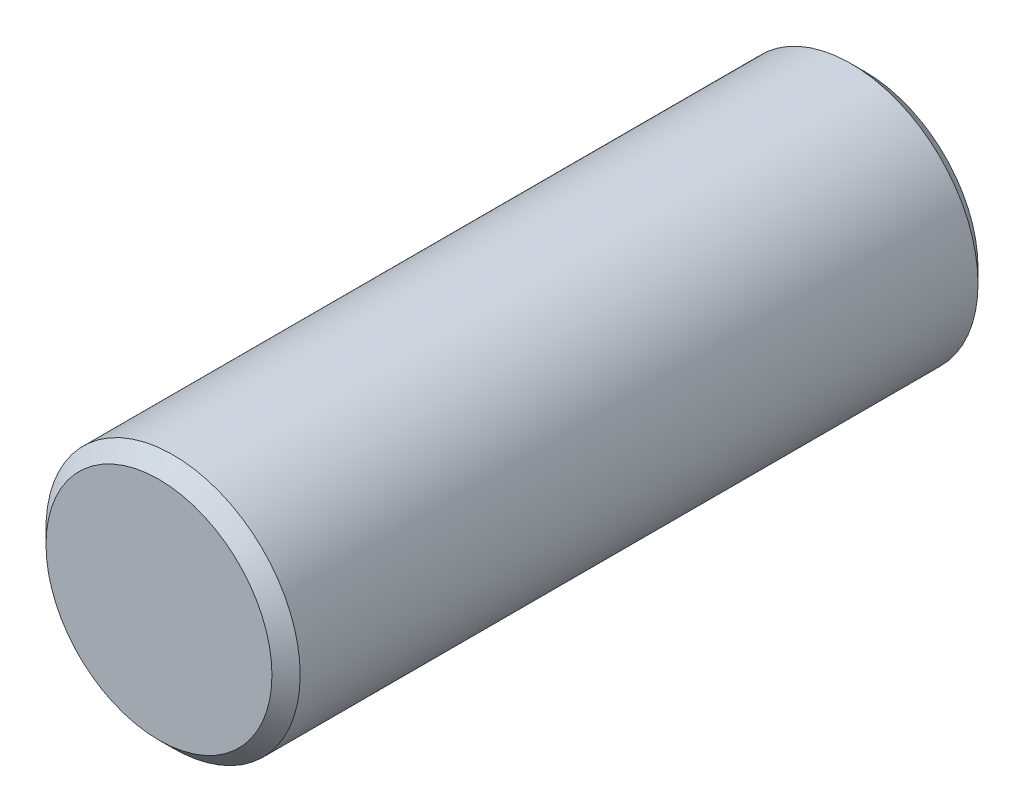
ISO-10303-21;
HEADER;
FILE_DESCRIPTION(('STEP AP214'),'2;1');
FILE_NAME('part.step','',(''),(''),'','','');
FILE_SCHEMA(('AUTOMOTIVE_DESIGN { 1 0 10303 214 1 1 1 1 }'));
ENDSEC;
DATA;
#1=APPLICATION_CONTEXT('core data for automotive mechanical design processes');
#2=APPLICATION_PROTOCOL_DEFINITION('international standard','automotive_design',2000,#1);
#3=PRODUCT_CONTEXT('',#1,'mechanical');
#4=PRODUCT('Part','Part','',(#3));
#5=PRODUCT_RELATED_PRODUCT_CATEGORY('part','',(#4));
#6=PRODUCT_DEFINITION_FORMATION('','',#4);
#7=PRODUCT_DEFINITION_CONTEXT('part definition',#1,'design');
#8=PRODUCT_DEFINITION('design','',#6,#7);
#9=PRODUCT_DEFINITION_SHAPE('','',#8);
#10=(LENGTH_UNIT() NAMED_UNIT(*) SI_UNIT(.MILLI.,.METRE.));
#11=(NAMED_UNIT(*) PLANE_ANGLE_UNIT() SI_UNIT($,.RADIAN.));
#12=(NAMED_UNIT(*) SI_UNIT($,.STERADIAN.) SOLID_ANGLE_UNIT());
#13=UNCERTAINTY_MEASURE_WITH_UNIT(LENGTH_MEASURE(1.E-05),#10,'distance_accuracy_value','');
#14=(GEOMETRIC_REPRESENTATION_CONTEXT(3) GLOBAL_UNCERTAINTY_ASSIGNED_CONTEXT((#13)) GLOBAL_UNIT_ASSIGNED_CONTEXT((#10,
#11,#12)) REPRESENTATION_CONTEXT('',''));
#15=CARTESIAN_POINT('',(0.,0.,0.));
#16=DIRECTION('',(0.,0.,1.));
#17=DIRECTION('',(1.,0.,0.));
#18=AXIS2_PLACEMENT_3D('',#15,#16,#17);
#19=CARTESIAN_POINT('',(0.,0.,50.));
#20=DIRECTION('',(0.,0.,-1.));
#21=DIRECTION('',(-1.,0.,0.));
#22=AXIS2_PLACEMENT_3D('',#19,#20,#21);
#23=CYLINDRICAL_SURFACE('',#22,9.);
#24=CARTESIAN_POINT('',(0.,0.,1.));
#25=DIRECTION('',(0.,0.,1.));
#26=DIRECTION('',(1.,0.,0.));
#27=AXIS2_PLACEMENT_3D('',#24,#25,#26);
#28=CIRCLE('',#27,9.);
#29=CARTESIAN_POINT('',(9.,0.,1.));
#30=VERTEX_POINT('',#29);
#31=EDGE_CURVE('E41',#30,#30,#28,.T.);
#32=ORIENTED_EDGE('',*,*,#31,.T.);
#33=EDGE_LOOP('',(#32));
#34=FACE_BOUND('',#33,.T.);
#35=CARTESIAN_POINT('',(0.,0.,49.));
#36=DIRECTION('',(0.,0.,1.));
#37=DIRECTION('',(1.,0.,0.));
#38=AXIS2_PLACEMENT_3D('',#35,#36,#37);
#39=CIRCLE('',#38,9.);
#40=CARTESIAN_POINT('',(9.,0.,49.));
#41=VERTEX_POINT('',#40);
#42=EDGE_CURVE('E45',#41,#41,#39,.F.);
#43=ORIENTED_EDGE('',*,*,#42,.T.);
#44=EDGE_LOOP('',(#43));
#45=FACE_BOUND('',#44,.T.);
#46=ADVANCED_FACE('F30',(#34,#45),#23,.T.);
#47=CARTESIAN_POINT('',(0.,0.,50.));
#48=DIRECTION('',(0.,0.,1.));
#49=DIRECTION('',(1.,0.,0.));
#50=AXIS2_PLACEMENT_3D('',#47,#48,#49);
#51=PLANE('',#50);
#52=CARTESIAN_POINT('',(0.,0.,50.));
#53=DIRECTION('',(0.,0.,1.));
#54=DIRECTION('',(1.,0.,0.));
#55=AXIS2_PLACEMENT_3D('',#52,#53,#54);
#56=CIRCLE('',#55,8.00000000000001);
#57=CARTESIAN_POINT('',(8.00000000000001,0.,50.));
#58=VERTEX_POINT('',#57);
#59=EDGE_CURVE('E10',#58,#58,#56,.T.);
#60=ORIENTED_EDGE('',*,*,#59,.T.);
#61=EDGE_LOOP('',(#60));
#62=FACE_BOUND('',#61,.T.);
#63=ADVANCED_FACE('F61',(#62),#51,.T.);
#64=CARTESIAN_POINT('',(0.,0.,0.));
#65=DIRECTION('',(0.,0.,1.));
#66=DIRECTION('',(1.,0.,0.));
#67=AXIS2_PLACEMENT_3D('',#64,#65,#66);
#68=PLANE('',#67);
#69=CARTESIAN_POINT('',(0.,0.,0.));
#70=DIRECTION('',(0.,0.,1.));
#71=DIRECTION('',(1.,0.,0.));
#72=AXIS2_PLACEMENT_3D('',#69,#70,#71);
#73=CIRCLE('',#72,8.);
#74=CARTESIAN_POINT('',(8.,0.,0.));
#75=VERTEX_POINT('',#74);
#76=EDGE_CURVE('E37',#75,#75,#73,.F.);
#77=ORIENTED_EDGE('',*,*,#76,.T.);
#78=EDGE_LOOP('',(#77));
#79=FACE_BOUND('',#78,.T.);
#80=ADVANCED_FACE('F58',(#79),#68,.F.);
#81=CARTESIAN_POINT('',(0.,0.,1.));
#82=DIRECTION('',(0.,0.,1.));
#83=DIRECTION('',(1.,0.,0.));
#84=AXIS2_PLACEMENT_3D('',#81,#82,#83);
#85=CONICAL_SURFACE('',#84,9.,0.785398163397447);
#86=ORIENTED_EDGE('',*,*,#76,.F.);
#87=EDGE_LOOP('',(#86));
#88=FACE_BOUND('',#87,.T.);
#89=ORIENTED_EDGE('',*,*,#31,.F.);
#90=EDGE_LOOP('',(#89));
#91=FACE_BOUND('',#90,.T.);
#92=ADVANCED_FACE('F54',(#88,#91),#85,.T.);
#93=CARTESIAN_POINT('',(0.,0.,50.));
#94=DIRECTION('',(0.,0.,-1.));
#95=DIRECTION('',(-1.,0.,0.));
#96=AXIS2_PLACEMENT_3D('',#93,#94,#95);
#97=CONICAL_SURFACE('',#96,8.00000000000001,0.785398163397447);
#98=ORIENTED_EDGE('',*,*,#42,.F.);
#99=EDGE_LOOP('',(#98));
#100=FACE_BOUND('',#99,.T.);
#101=ORIENTED_EDGE('',*,*,#59,.F.);
#102=EDGE_LOOP('',(#101));
#103=FACE_BOUND('',#102,.T.);
#104=ADVANCED_FACE('F32',(#100,#103),#97,.T.);
#105=CLOSED_SHELL('',(#46,#63,#80,#92,#104));
#106=MANIFOLD_SOLID_BREP('B2',#105);
#107=ADVANCED_BREP_SHAPE_REPRESENTATION('',(#18,#106),#14);
#108=SHAPE_DEFINITION_REPRESENTATION(#9,#107);
ENDSEC;
END-ISO-10303-21;
